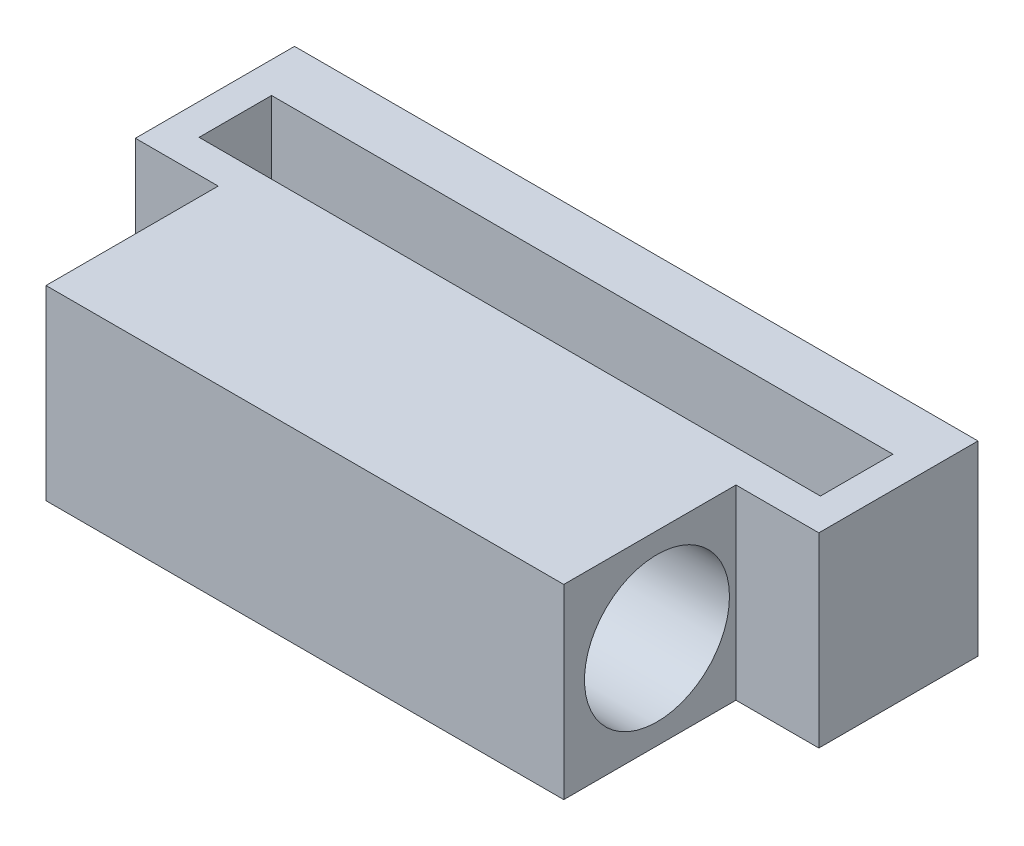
from build123d import *

# Parameters (mm, degrees)
ESQUISSE1_W             = 25
ESQUISSE1_H             = 16
BOSS_EXTRU_1_DEPTH      = 9
ESQUISSE2_R             = 3.5
ENL_V_MAT_EXTRU_1_DEPTH = 32.016124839
BOSS_EXTRU_2_DEPTH      = 4
BOSS_EXTRU_2_DEPTH_BACK = 29
ESQUISSE5_W             = 7.685000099
ESQUISSE5_H             = 9
ESQUISSE3_W             = 30
ESQUISSE3_H             = 3.5
ENL_V_MAT_EXTRU_3_DEPTH = 35.322004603


with BuildPart() as part:
    # Esquisse1 → Boss.-Extru.1 (new body)
    with BuildSketch(Plane(origin=(0, 0, 0), x_dir=(1, 0, 0), z_dir=(0, 1, 0))):
        with Locations((12.5, 8)):
            Rectangle(ESQUISSE1_W, ESQUISSE1_H)
    extrude(amount=BOSS_EXTRU_1_DEPTH)

    # Esquisse2 → Enl_v. mat.-Extru.1 (cut, through all)
    with BuildSketch(Plane(origin=(25, 0, 0), x_dir=(0, 0, -1), z_dir=(1, 0, 0))):
        with Locations((4.5, 4.5)):
            Circle(ESQUISSE2_R)
    extrude(amount=-ENL_V_MAT_EXTRU_1_DEPTH, mode=Mode.SUBTRACT)

    # Esquisse5 → Boss.-Extru.2 (add, two sides: drawn at the far end of the back side and taken through both)
    with BuildSketch(Plane(origin=(25, 0, 0), x_dir=(0, 0, -1), z_dir=(1, 0, 0)).offset(-BOSS_EXTRU_2_DEPTH_BACK)):
        with Locations((12.157499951, 4.5)):
            Rectangle(ESQUISSE5_W, ESQUISSE5_H)
    extrude(amount=BOSS_EXTRU_2_DEPTH + BOSS_EXTRU_2_DEPTH_BACK)

    # Esquisse3 → Enl_v. mat.-Extru.3 (cut, through all)
    with BuildSketch(Plane(origin=(0, 9, 0), x_dir=(1, 0, 0), z_dir=(0, 1, 0))):
        with Locations((12.5, 11.640847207)):
            Rectangle(ESQUISSE3_W, ESQUISSE3_H)
    extrude(amount=-ENL_V_MAT_EXTRU_3_DEPTH, mode=Mode.SUBTRACT)


solid = part.part
